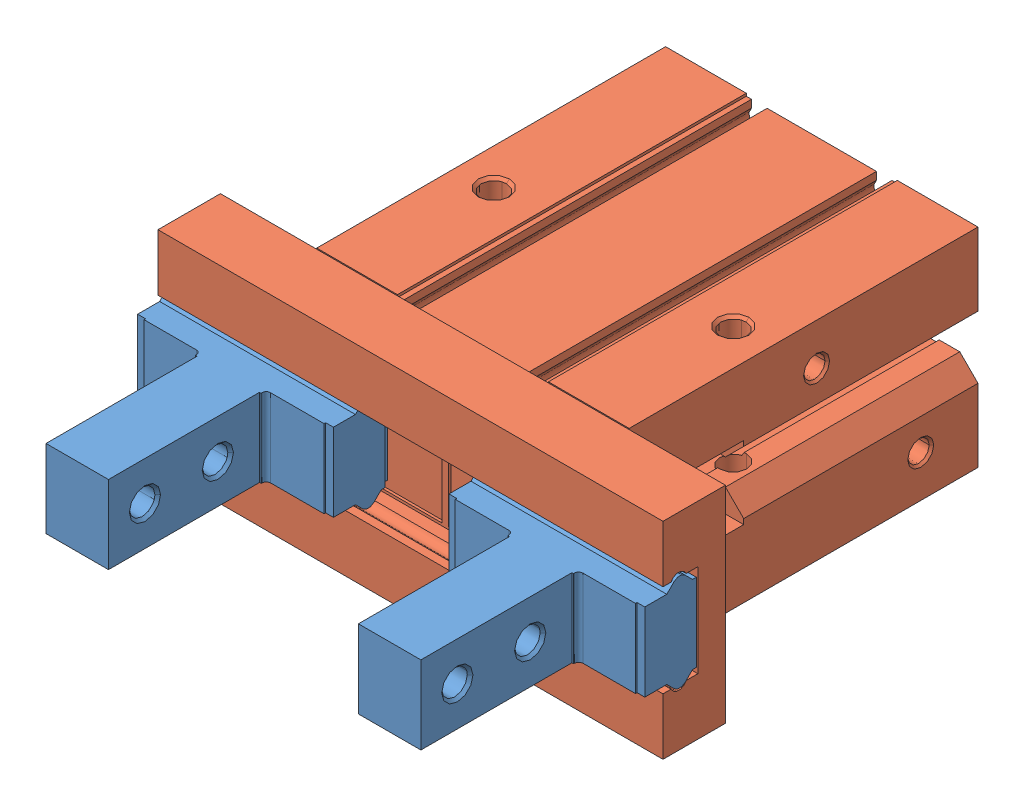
SolidWorks assembly SHZ32D_48_0_.sldasm, configuration Default (file format 11000). Lengths in mm.
Overall size (97.4 40 113).
3 component instances, 2 part files, 0 mates.
Components (placement in the parent):
- SHZ32D_48_0__3-1: SHZ32D_48_0__3.sldprt [Default] at (0 0 72.8) size (37.6 18.7 41.2)
- SHZ32D_48_0__3-2: SHZ32D_48_0__3.sldprt [Default] at (0 0 72.8) x (-1 0 0) z (0 0 1) size (37.6 18.7 41.2)
- SHZ32D_48_0__6-1: SHZ32D_48_0__6.sldprt [Default] at origin size (97 40 79)
